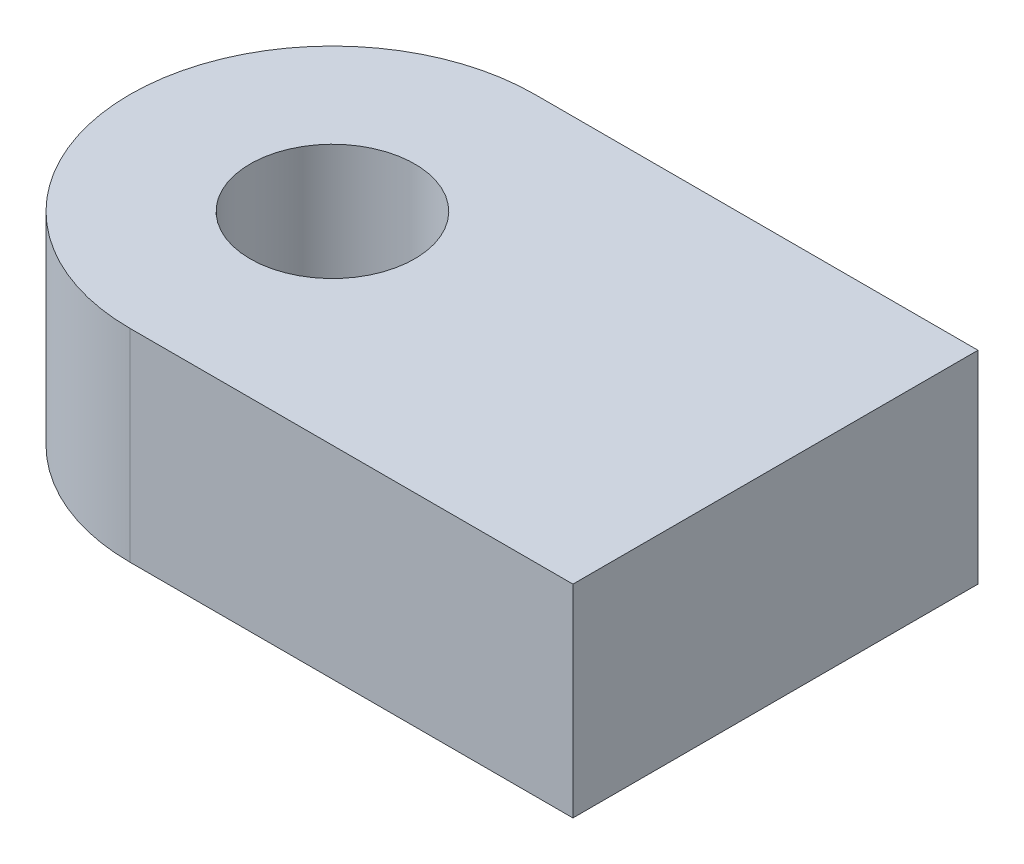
from build123d import *

# Parameters (mm, degrees)
BOSS_EXTRUDE1_DEPTH = 16
SKETCH2_R           = 6.5
CUT_EXTRUDE1_DEPTH  = 42.677331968


with BuildPart() as part:
    # Sketch1 → Boss-Extrude1 (new body)
    with BuildSketch(Plane(origin=(0, 0, 0), x_dir=(1, 0, 0), z_dir=(0, 1, 0))):
        with BuildLine():
            Line((35, -16), (0, -16))
            ThreePointArc((0, -16), (-16, 0), (0, 16))
            Line((0, 16), (35, 16))
            Line((35, 16), (35, -16))
        make_face()
    extrude(amount=BOSS_EXTRUDE1_DEPTH)

    # Sketch2 → Cut-Extrude1 (cut, through all)
    with BuildSketch(Plane(origin=(0, 16, 0), x_dir=(1, 0, 0), z_dir=(0, 1, 0))):
        with Locations(Location((0, 0, 0), (0, 0, 270))):
            Circle(SKETCH2_R)
    extrude(amount=-CUT_EXTRUDE1_DEPTH, mode=Mode.SUBTRACT)


solid = part.part
